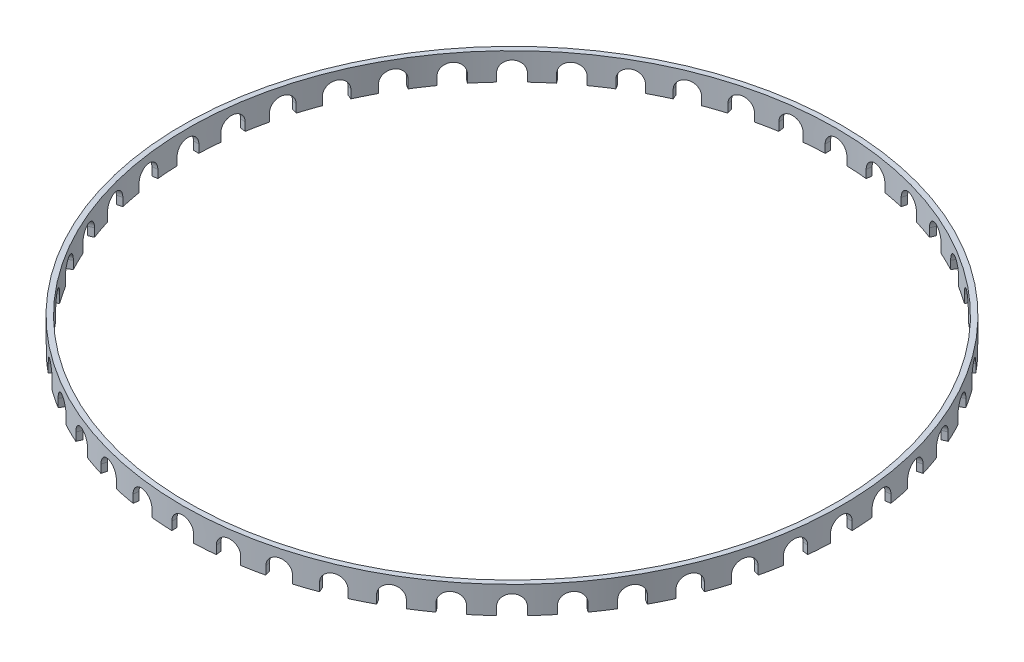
from build123d import *

# Parameters (mm, degrees)
SKETCH1_W                     = 0.9906
SKETCH1_H                     = 5.08
CUT_EXTRUDE_POCKET_REACH      = 89.208
CUT_EXTRUDE_POCKET_END_RADIUS = 61.61405
CIRPATTERN_POCKET_COUNT       = 48
CIRPATTERN_POCKET_ANGLE       = 352.5


with BuildPart() as part:
    # Sketch1 → Base-Revolve (revolve)
    with BuildSketch(Plane.XY, mode=Mode.PRIVATE) as base_revolve_sk:
        with Locations((-61.11875, 1.016)):
            Rectangle(SKETCH1_W, SKETCH1_H)
    revolve(base_revolve_sk.sketch.rotate(Axis((0, 0, 0), (0, 1, 0)), 270), axis=Axis((0, 0, 0), (0, 1, 0)))

    # Cut-Extrude Pocket: up to this cylinder (the profile starts inside it)
    cut_extrude_pocket_end = Plane(origin=(0, 0.068929, 0), z_dir=(0, -1, 0)) * Cylinder(CUT_EXTRUDE_POCKET_END_RADIUS, 302.6441, mode=Mode.PRIVATE)
    # Sketch2 → Cut-Extrude Pocket (cut, up to the surface)
    with BuildSketch(Plane(origin=(0, 0, 0), x_dir=(0, 0, -1), z_dir=(1, 0, 0)), mode=Mode.PRIVATE) as cut_extrude_pocket_sk1:
        with BuildLine():
            Line((-2.032, -1.524), (2.032, -1.524))
            Line((2.032, -1.524), (2.032, 0))
            ThreePointArc((2.032, 0), (0, 2.032), (-2.032, 0))
            Line((-2.032, 0), (-2.032, -1.524))
        make_face()
    cut_extrude_pocket_tool1 = extrude(cut_extrude_pocket_sk1.sketch, amount=-CUT_EXTRUDE_POCKET_REACH, mode=Mode.PRIVATE) & cut_extrude_pocket_end
    cut_extrude_pocket = cut_extrude_pocket_tool1.solids().sort_by_distance((0, 0.068929, 0))[0]
    add(cut_extrude_pocket, mode=Mode.SUBTRACT)

    # CirPattern Pocket: Cut-Extrude Pocket ×48 about axis
    cirpattern_pocket_axis = Axis((0, 0, 0), (0, 1, 0))
    for i in range(1, CIRPATTERN_POCKET_COUNT):
        add(cut_extrude_pocket.rotate(cirpattern_pocket_axis, i * CIRPATTERN_POCKET_ANGLE / (CIRPATTERN_POCKET_COUNT - 1)), mode=Mode.SUBTRACT)


solid = part.part
